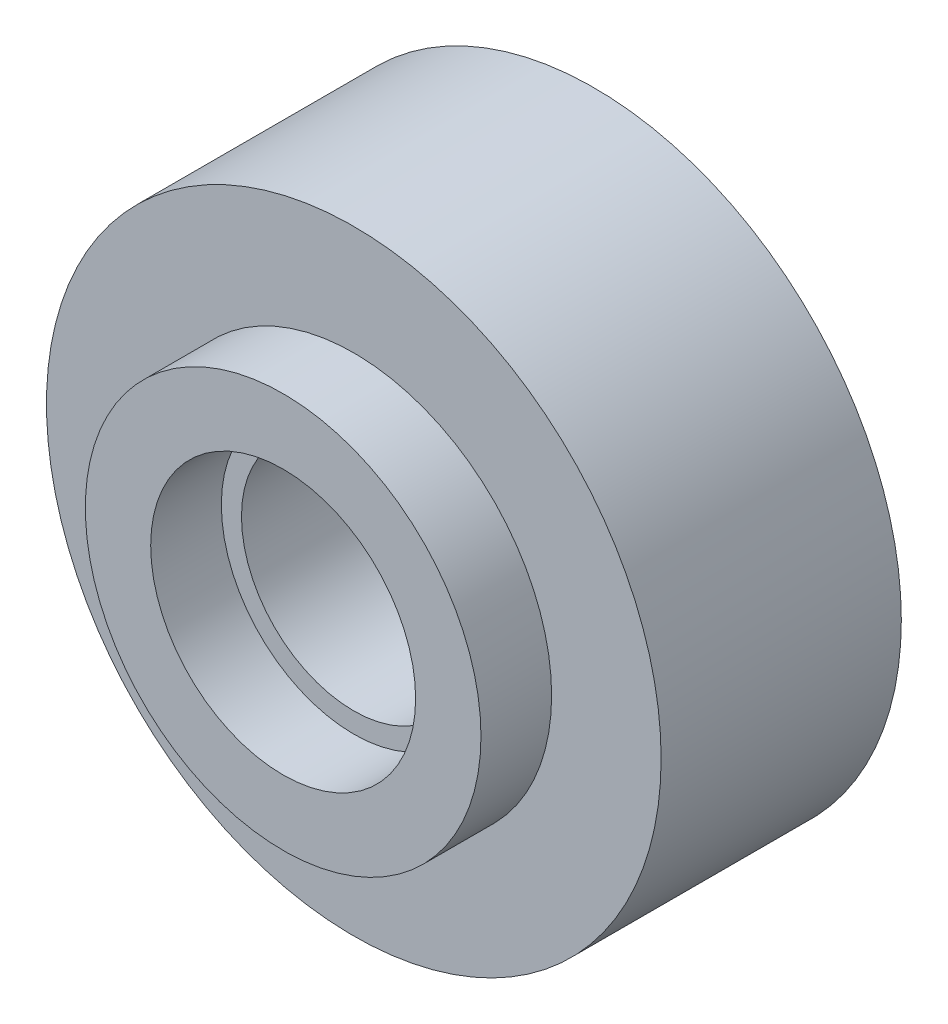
from build123d import *

# Parameters (mm, degrees)
SKETCH1_R          = 5.5245
BASE_DEPTH         = 5.588
SKETCH2_R          = 2.38125
VENT_AREA_DEPTH    = 1.27
SKETCH3_OUTSIDE_W  = 16.366
SKETCH3_OUTSIDE_H  = 16.366
SKETCH3_OUTSIDE_R  = 3.556
ORING_GROOVE_DEPTH = 1.27
SKETCH4_R          = 2.0193
THRU_HOLE_DEPTH    = 10.605516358


with BuildPart() as part:
    # Sketch1 → base (new body)
    with BuildSketch(Plane.XY):
        Circle(SKETCH1_R)
    extrude(amount=BASE_DEPTH)

    # Sketch2 → vent_area (cut)
    with BuildSketch(Plane.XY.offset(5.588)):
        Circle(SKETCH2_R)
    extrude(amount=-VENT_AREA_DEPTH, mode=Mode.SUBTRACT)

    # Sketch3 outside → oring_groove (cut)
    with BuildSketch(Plane.XY.offset(5.588)):
        Rectangle(SKETCH3_OUTSIDE_W, SKETCH3_OUTSIDE_H)
        Circle(SKETCH3_OUTSIDE_R, mode=Mode.SUBTRACT)
    extrude(amount=-ORING_GROOVE_DEPTH, mode=Mode.SUBTRACT)

    # Sketch4 → thru_hole (cut, through all)
    with BuildSketch(Plane(origin=(0, 0, 0), x_dir=(-1, 0, 0), z_dir=(0, 0, -1))):
        Circle(SKETCH4_R)
    extrude(amount=-THRU_HOLE_DEPTH, mode=Mode.SUBTRACT)


solid = part.part
